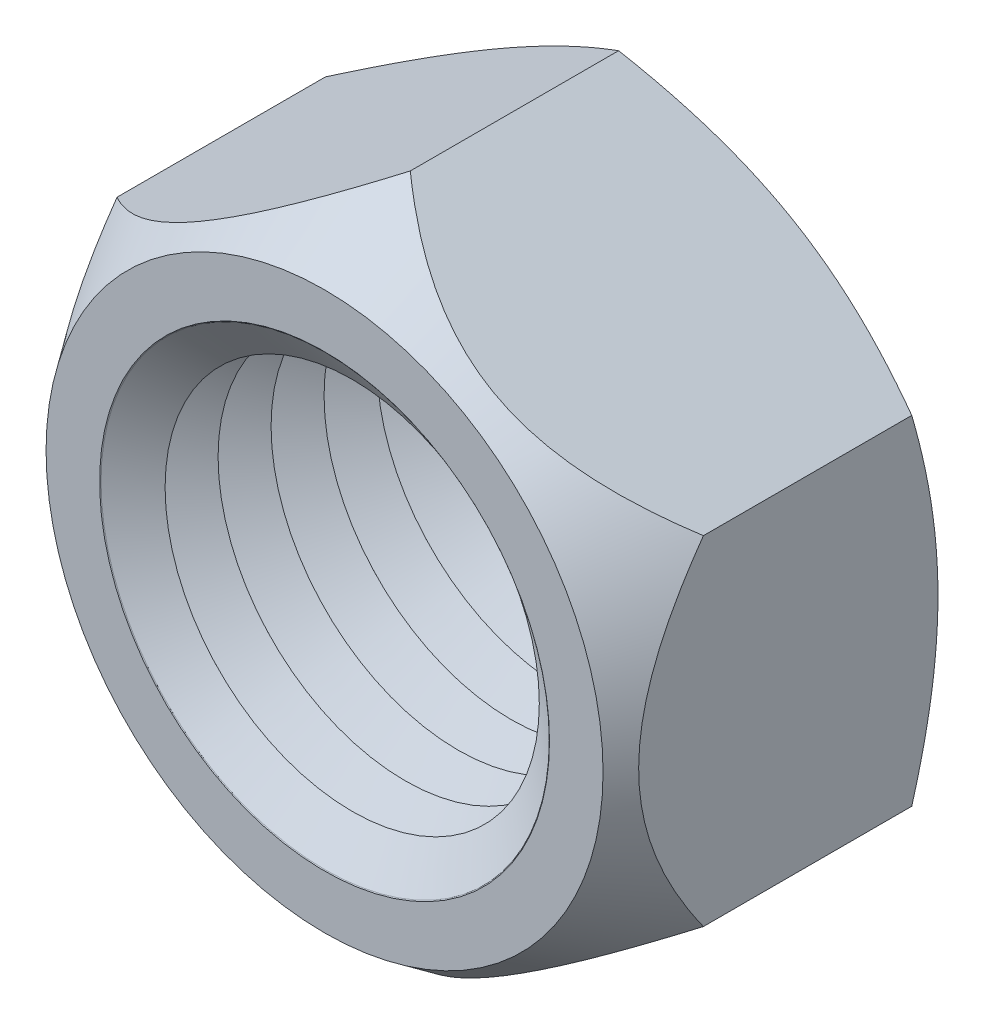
ISO-10303-21;
HEADER;
FILE_DESCRIPTION(('STEP AP214'),'2;1');
FILE_NAME('part.step','',(''),(''),'','','');
FILE_SCHEMA(('AUTOMOTIVE_DESIGN { 1 0 10303 214 1 1 1 1 }'));
ENDSEC;
DATA;
#1=APPLICATION_CONTEXT('core data for automotive mechanical design processes');
#2=APPLICATION_PROTOCOL_DEFINITION('international standard','automotive_design',2000,#1);
#3=PRODUCT_CONTEXT('',#1,'mechanical');
#4=PRODUCT('Part','Part','',(#3));
#5=PRODUCT_RELATED_PRODUCT_CATEGORY('part','',(#4));
#6=PRODUCT_DEFINITION_FORMATION('','',#4);
#7=PRODUCT_DEFINITION_CONTEXT('part definition',#1,'design');
#8=PRODUCT_DEFINITION('design','',#6,#7);
#9=PRODUCT_DEFINITION_SHAPE('','',#8);
#10=(LENGTH_UNIT() NAMED_UNIT(*) SI_UNIT(.MILLI.,.METRE.));
#11=(NAMED_UNIT(*) PLANE_ANGLE_UNIT() SI_UNIT($,.RADIAN.));
#12=(NAMED_UNIT(*) SI_UNIT($,.STERADIAN.) SOLID_ANGLE_UNIT());
#13=UNCERTAINTY_MEASURE_WITH_UNIT(LENGTH_MEASURE(1.E-05),#10,'distance_accuracy_value','');
#14=(GEOMETRIC_REPRESENTATION_CONTEXT(3) GLOBAL_UNCERTAINTY_ASSIGNED_CONTEXT((#13)) GLOBAL_UNIT_ASSIGNED_CONTEXT((#10,
#11,#12)) REPRESENTATION_CONTEXT('',''));
#15=CARTESIAN_POINT('',(0.,0.,0.));
#16=DIRECTION('',(0.,0.,1.));
#17=DIRECTION('',(1.,0.,0.));
#18=AXIS2_PLACEMENT_3D('',#15,#16,#17);
#19=CARTESIAN_POINT('',(0.,7.50555349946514,-7.1));
#20=DIRECTION('',(-0.500000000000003,0.866025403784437,0.));
#21=DIRECTION('',(-0.866025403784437,-0.500000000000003,0.));
#22=AXIS2_PLACEMENT_3D('',#19,#20,#21);
#23=PLANE('',#22);
#24=DIRECTION('',(0.,0.,1.));
#25=VECTOR('',#24,1.);
#26=CARTESIAN_POINT('',(-6.5,3.75277674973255,-7.1));
#27=LINE('',#26,#25);
#28=CARTESIAN_POINT('',(-6.5,3.75277674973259,-6.51944341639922));
#29=VERTEX_POINT('',#28);
#30=CARTESIAN_POINT('',(-6.5,3.75277674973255,-1.90022732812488));
#31=VERTEX_POINT('',#30);
#32=EDGE_CURVE('E146',#29,#31,#27,.T.);
#33=ORIENTED_EDGE('',*,*,#32,.T.);
#34=CARTESIAN_POINT('',(-6.5002,3.75266127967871,-1.90039224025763));
#35=CARTESIAN_POINT('',(-6.43030638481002,3.79301437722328,-1.84276391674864));
#36=CARTESIAN_POINT('',(-6.35984649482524,3.83369441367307,-1.78605340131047));
#37=CARTESIAN_POINT('',(-6.21769338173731,3.91576655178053,-1.67469364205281));
#38=CARTESIAN_POINT('',(-6.14599988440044,3.95715881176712,-1.62004486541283));
#39=CARTESIAN_POINT('',(-5.92849119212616,4.08273751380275,-1.45921760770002));
#40=CARTESIAN_POINT('',(-5.78070483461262,4.16806200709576,-1.35653915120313));
#41=CARTESIAN_POINT('',(-5.47618935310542,4.34387410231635,-1.16097929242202));
#42=CARTESIAN_POINT('',(-5.31933714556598,4.43443276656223,-1.06835130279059));
#43=CARTESIAN_POINT('',(-4.99947791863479,4.61910357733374,-0.898933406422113));
#44=CARTESIAN_POINT('',(-4.83647955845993,4.71321072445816,-0.822122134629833));
#45=CARTESIAN_POINT('',(-4.55723148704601,4.87443467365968,-0.709447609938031));
#46=CARTESIAN_POINT('',(-4.44257193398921,4.94063339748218,-0.66832663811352));
#47=CARTESIAN_POINT('',(-4.21079269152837,5.07445120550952,-0.596523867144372));
#48=CARTESIAN_POINT('',(-4.09367294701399,5.14207032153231,-0.565842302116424));
#49=CARTESIAN_POINT('',(-3.8587182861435,5.27772145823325,-0.516308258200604));
#50=CARTESIAN_POINT('',(-3.74090108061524,5.34574325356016,-0.497344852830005));
#51=CARTESIAN_POINT('',(-3.50426924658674,5.48236270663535,-0.471574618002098));
#52=CARTESIAN_POINT('',(-3.38545468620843,5.55096032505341,-0.464766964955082));
#53=CARTESIAN_POINT('',(-3.14745443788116,5.68836983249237,-0.463608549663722));
#54=CARTESIAN_POINT('',(-3.02826862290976,5.75718179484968,-0.469291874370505));
#55=CARTESIAN_POINT('',(-2.79081684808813,5.89427464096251,-0.492929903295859));
#56=CARTESIAN_POINT('',(-2.67255095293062,5.96255548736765,-0.510885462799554));
#57=CARTESIAN_POINT('',(-2.43663452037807,6.09876190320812,-0.558543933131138));
#58=CARTESIAN_POINT('',(-2.31900127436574,6.16667748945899,-0.588359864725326));
#59=CARTESIAN_POINT('',(-2.08616917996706,6.30110316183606,-0.658594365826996));
#60=CARTESIAN_POINT('',(-1.9709702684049,6.36761328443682,-0.699012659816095));
#61=CARTESIAN_POINT('',(-1.68852237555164,6.53068465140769,-0.810888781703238));
#62=CARTESIAN_POINT('',(-1.52292759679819,6.62629084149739,-0.887920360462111));
#63=CARTESIAN_POINT('',(-1.19804471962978,6.81386205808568,-1.05838662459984));
#64=CARTESIAN_POINT('',(-1.03876610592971,6.90582160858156,-1.1518449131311));
#65=CARTESIAN_POINT('',(-0.7296323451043,7.08430006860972,-1.34947648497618));
#66=CARTESIAN_POINT('',(-0.579650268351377,7.17089226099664,-1.4533873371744));
#67=CARTESIAN_POINT('',(-0.358984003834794,7.29829398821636,-1.61627110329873));
#68=CARTESIAN_POINT('',(-0.286268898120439,7.34027607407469,-1.67163312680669));
#69=CARTESIAN_POINT('',(-0.142108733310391,7.42350698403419,-1.78448009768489));
#70=CARTESIAN_POINT('',(-0.070663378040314,7.46475597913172,-1.8419645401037));
#71=CARTESIAN_POINT('',(0.000199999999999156,7.50566896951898,-1.90039224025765));
#72=B_SPLINE_CURVE_WITH_KNOTS('',3,(#34,#35,#36,#37,#38,#39,#40,#41,#42,#43,#44,#45,#46,#47,#48,
#49,#50,#51,#52,#53,#54,#55,#56,#57,#58,#59,#60,#61,#62,#63,#64,#65,#66,#67,#68,#69,#70,#71),
.UNSPECIFIED.,.F.,.F.,(4,2,2,2,2,2,2,2,2,2,2,2,2,2,2,2,2,2,4),(0.,0.297495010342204,
0.595057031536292,1.19213126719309,1.80184521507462,2.41073008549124,2.82627683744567,
3.24183290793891,3.6533924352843,4.06492407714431,4.4775801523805,4.89026498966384,
5.30698041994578,5.72368502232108,6.34109186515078,6.95939320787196,7.56487092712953,
7.86656422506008,8.16818620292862),.UNSPECIFIED.);
#73=CARTESIAN_POINT('',(0.,7.50555349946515,-1.90022732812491));
#74=VERTEX_POINT('',#73);
#75=EDGE_CURVE('E60',#31,#74,#72,.T.);
#76=ORIENTED_EDGE('',*,*,#75,.T.);
#77=DIRECTION('',(0.,0.,1.));
#78=VECTOR('',#77,1.);
#79=CARTESIAN_POINT('',(0.,7.50555349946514,-7.1));
#80=LINE('',#79,#78);
#81=CARTESIAN_POINT('',(0.,7.50555349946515,-6.51944341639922));
#82=VERTEX_POINT('',#81);
#83=EDGE_CURVE('E129',#82,#74,#80,.T.);
#84=ORIENTED_EDGE('',*,*,#83,.F.);
#85=CARTESIAN_POINT('',(-6.5002,3.75266127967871,-6.51937674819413));
#86=CARTESIAN_POINT('',(-6.35732254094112,3.83515161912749,-6.56699557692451));
#87=CARTESIAN_POINT('',(-6.21391236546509,3.91794952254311,-6.61245329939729));
#88=CARTESIAN_POINT('',(-5.92592736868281,4.08421773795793,-6.69845131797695));
#89=CARTESIAN_POINT('',(-5.78135207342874,4.16768832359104,-6.73898949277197));
#90=CARTESIAN_POINT('',(-5.34531134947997,4.4194365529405,-6.85242899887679));
#91=CARTESIAN_POINT('',(-5.05212471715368,4.58870793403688,-6.91695219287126));
#92=CARTESIAN_POINT('',(-4.61337625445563,4.84201947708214,-6.99261341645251));
#93=CARTESIAN_POINT('',(-4.46912536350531,4.92530276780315,-7.01416714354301));
#94=CARTESIAN_POINT('',(-4.17997178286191,5.09224566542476,-7.05030968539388));
#95=CARTESIAN_POINT('',(-4.03506915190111,5.17590523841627,-7.06489911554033));
#96=CARTESIAN_POINT('',(-3.74501222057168,5.34336968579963,-7.08674124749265));
#97=CARTESIAN_POINT('',(-3.59985839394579,5.42717428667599,-7.09400227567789));
#98=CARTESIAN_POINT('',(-3.30942466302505,5.59485627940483,-7.10103969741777));
#99=CARTESIAN_POINT('',(-3.16414476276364,5.6787336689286,-7.10081632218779));
#100=CARTESIAN_POINT('',(-2.76612405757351,5.90853103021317,-7.08991654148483));
#101=CARTESIAN_POINT('',(-2.51351353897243,6.05437578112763,-7.07161818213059));
#102=CARTESIAN_POINT('',(-2.00997032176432,6.34509659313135,-7.01359365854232));
#103=CARTESIAN_POINT('',(-1.75903939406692,6.48997163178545,-6.97384766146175));
#104=CARTESIAN_POINT('',(-1.25448277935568,6.78127752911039,-6.87449409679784));
#105=CARTESIAN_POINT('',(-1.00092075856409,6.92767163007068,-6.81446557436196));
#106=CARTESIAN_POINT('',(-0.497578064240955,7.21827667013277,-6.67822500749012));
#107=CARTESIAN_POINT('',(-0.247790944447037,7.3624913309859,-6.60204496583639));
#108=CARTESIAN_POINT('',(0.000199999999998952,7.50566896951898,-6.51937674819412));
#109=B_SPLINE_CURVE_WITH_KNOTS('',3,(#85,#86,#87,#88,#89,#90,#91,#92,#93,#94,#95,#96,#97,#98,
#99,#100,#101,#102,#103,#104,#105,#106,#107,#108),.UNSPECIFIED.,.F.,.F.,(4,2,2,2,2,2,2,2,2,2,2,
4),(0.,0.515105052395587,1.03043143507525,2.06322554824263,2.56697389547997,3.07067772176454,
3.57380860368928,4.0769239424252,4.95279354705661,5.82947446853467,6.72559912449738,
7.61996451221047),.UNSPECIFIED.);
#110=CARTESIAN_POINT('',(-3.25000000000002,5.62916512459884,-7.1));
#111=VERTEX_POINT('',#110);
#112=EDGE_CURVE('E149',#111,#82,#109,.T.);
#113=ORIENTED_EDGE('',*,*,#112,.F.);
#114=EDGE_CURVE('E272',#29,#111,#109,.T.);
#115=ORIENTED_EDGE('',*,*,#114,.F.);
#116=EDGE_LOOP('',(#33,#76,#84,#113,#115));
#117=FACE_BOUND('',#116,.T.);
#118=ADVANCED_FACE('F39',(#117),#23,.T.);
#119=CARTESIAN_POINT('',(6.5,3.75277674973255,-7.1));
#120=DIRECTION('',(0.500000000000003,0.866025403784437,0.));
#121=DIRECTION('',(-0.866025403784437,0.500000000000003,0.));
#122=AXIS2_PLACEMENT_3D('',#119,#120,#121);
#123=PLANE('',#122);
#124=ORIENTED_EDGE('',*,*,#83,.T.);
#125=CARTESIAN_POINT('',(-0.000200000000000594,7.50566896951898,-1.90039224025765));
#126=CARTESIAN_POINT('',(0.0696936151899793,7.46531587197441,-1.84276391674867));
#127=CARTESIAN_POINT('',(0.14015350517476,7.42463583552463,-1.78605340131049));
#128=CARTESIAN_POINT('',(0.282306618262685,7.34256369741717,-1.67469364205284));
#129=CARTESIAN_POINT('',(0.354000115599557,7.30117143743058,-1.62004486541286));
#130=CARTESIAN_POINT('',(0.571508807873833,7.17559273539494,-1.45921760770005));
#131=CARTESIAN_POINT('',(0.719295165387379,7.09026824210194,-1.35653915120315));
#132=CARTESIAN_POINT('',(1.02381064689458,6.91445614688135,-1.16097929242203));
#133=CARTESIAN_POINT('',(1.18066285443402,6.82389748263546,-1.06835130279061));
#134=CARTESIAN_POINT('',(1.50052208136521,6.63922667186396,-0.898933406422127));
#135=CARTESIAN_POINT('',(1.66352044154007,6.54511952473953,-0.822122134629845));
#136=CARTESIAN_POINT('',(1.94276851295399,6.38389557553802,-0.70944760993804));
#137=CARTESIAN_POINT('',(2.05742806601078,6.31769685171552,-0.668326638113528));
#138=CARTESIAN_POINT('',(2.28920730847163,6.18387904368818,-0.596523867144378));
#139=CARTESIAN_POINT('',(2.406327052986,6.11625992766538,-0.565842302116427));
#140=CARTESIAN_POINT('',(2.64128171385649,5.98060879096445,-0.516308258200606));
#141=CARTESIAN_POINT('',(2.75909891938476,5.91258699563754,-0.497344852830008));
#142=CARTESIAN_POINT('',(2.99573075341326,5.77596754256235,-0.471574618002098));
#143=CARTESIAN_POINT('',(3.11454531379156,5.70736992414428,-0.46476696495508));
#144=CARTESIAN_POINT('',(3.35254556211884,5.56996041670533,-0.463608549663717));
#145=CARTESIAN_POINT('',(3.47173137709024,5.50114845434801,-0.4692918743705));
#146=CARTESIAN_POINT('',(3.70918315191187,5.36405560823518,-0.492929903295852));
#147=CARTESIAN_POINT('',(3.82744904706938,5.29577476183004,-0.510885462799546));
#148=CARTESIAN_POINT('',(4.06336547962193,5.15956834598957,-0.558543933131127));
#149=CARTESIAN_POINT('',(4.18099872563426,5.0916527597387,-0.588359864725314));
#150=CARTESIAN_POINT('',(4.41383082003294,4.95722708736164,-0.658594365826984));
#151=CARTESIAN_POINT('',(4.5290297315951,4.89071696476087,-0.699012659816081));
#152=CARTESIAN_POINT('',(4.81147762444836,4.72764559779,-0.810888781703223));
#153=CARTESIAN_POINT('',(4.97707240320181,4.6320394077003,-0.887920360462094));
#154=CARTESIAN_POINT('',(5.30195528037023,4.44446819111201,-1.05838662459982));
#155=CARTESIAN_POINT('',(5.46123389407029,4.35250864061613,-1.15184491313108));
#156=CARTESIAN_POINT('',(5.7703676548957,4.17403018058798,-1.34947648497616));
#157=CARTESIAN_POINT('',(5.92034973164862,4.08743798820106,-1.45338733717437));
#158=CARTESIAN_POINT('',(6.14101599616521,3.96003626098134,-1.6162711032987));
#159=CARTESIAN_POINT('',(6.21373110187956,3.918054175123,-1.67163312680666));
#160=CARTESIAN_POINT('',(6.35789126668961,3.8348232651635,-1.78448009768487));
#161=CARTESIAN_POINT('',(6.42933662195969,3.79357427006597,-1.84196454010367));
#162=CARTESIAN_POINT('',(6.5002,3.75266127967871,-1.90039224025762));
#163=B_SPLINE_CURVE_WITH_KNOTS('',3,(#125,#126,#127,#128,#129,#130,#131,#132,#133,#134,#135,
#136,#137,#138,#139,#140,#141,#142,#143,#144,#145,#146,#147,#148,#149,#150,#151,#152,#153,#154,
#155,#156,#157,#158,#159,#160,#161,#162),.UNSPECIFIED.,.F.,.F.,(4,2,2,2,2,2,2,2,2,2,2,2,2,2,2,2,
2,2,4),(0.,0.297495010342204,0.595057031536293,1.19213126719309,1.80184521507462,
2.41073008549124,2.82627683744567,3.24183290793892,3.6533924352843,4.06492407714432,
4.47758015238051,4.89026498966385,5.30698041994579,5.72368502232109,6.34109186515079,
6.95939320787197,7.56487092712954,7.86656422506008,8.16818620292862),.UNSPECIFIED.);
#164=CARTESIAN_POINT('',(6.5,3.75277674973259,-1.90022732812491));
#165=VERTEX_POINT('',#164);
#166=EDGE_CURVE('E112',#74,#165,#163,.T.);
#167=ORIENTED_EDGE('',*,*,#166,.T.);
#168=DIRECTION('',(0.,0.,1.));
#169=VECTOR('',#168,1.);
#170=CARTESIAN_POINT('',(6.5,3.75277674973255,-7.1));
#171=LINE('',#170,#169);
#172=CARTESIAN_POINT('',(6.5,3.75277674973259,-6.51944341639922));
#173=VERTEX_POINT('',#172);
#174=EDGE_CURVE('E130',#173,#165,#171,.T.);
#175=ORIENTED_EDGE('',*,*,#174,.F.);
#176=CARTESIAN_POINT('',(-0.000200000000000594,7.50566896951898,-6.51937674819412));
#177=CARTESIAN_POINT('',(0.142677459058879,7.42317863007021,-6.5669955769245));
#178=CARTESIAN_POINT('',(0.286087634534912,7.34038072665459,-6.61245329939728));
#179=CARTESIAN_POINT('',(0.574072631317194,7.17411251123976,-6.69845131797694));
#180=CARTESIAN_POINT('',(0.718647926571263,7.09064192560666,-6.73898949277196));
#181=CARTESIAN_POINT('',(1.15468865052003,6.83889369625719,-6.85242899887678));
#182=CARTESIAN_POINT('',(1.44787528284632,6.66962231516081,-6.91695219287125));
#183=CARTESIAN_POINT('',(1.88662374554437,6.41631077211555,-6.9926134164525));
#184=CARTESIAN_POINT('',(2.03087463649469,6.33302748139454,-7.01416714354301));
#185=CARTESIAN_POINT('',(2.32002821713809,6.16608458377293,-7.05030968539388));
#186=CARTESIAN_POINT('',(2.46493084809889,6.08242501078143,-7.06489911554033));
#187=CARTESIAN_POINT('',(2.75498777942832,5.91496056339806,-7.08674124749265));
#188=CARTESIAN_POINT('',(2.90014160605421,5.8311559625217,-7.09400227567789));
#189=CARTESIAN_POINT('',(3.19057533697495,5.66347396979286,-7.10103969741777));
#190=CARTESIAN_POINT('',(3.33585523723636,5.57959658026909,-7.1008163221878));
#191=CARTESIAN_POINT('',(3.73387594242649,5.34979921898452,-7.08991654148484));
#192=CARTESIAN_POINT('',(3.98648646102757,5.20395446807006,-7.07161818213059));
#193=CARTESIAN_POINT('',(4.49002967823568,4.91323365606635,-7.01359365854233));
#194=CARTESIAN_POINT('',(4.74096060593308,4.76835861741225,-6.97384766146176));
#195=CARTESIAN_POINT('',(5.24551722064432,4.4770527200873,-6.87449409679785));
#196=CARTESIAN_POINT('',(5.49907924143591,4.33065861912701,-6.81446557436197));
#197=CARTESIAN_POINT('',(6.00242193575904,4.04005357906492,-6.67822500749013));
#198=CARTESIAN_POINT('',(6.25220905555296,3.8958389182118,-6.6020449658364));
#199=CARTESIAN_POINT('',(6.5002,3.75266127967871,-6.51937674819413));
#200=B_SPLINE_CURVE_WITH_KNOTS('',3,(#176,#177,#178,#179,#180,#181,#182,#183,#184,#185,#186,
#187,#188,#189,#190,#191,#192,#193,#194,#195,#196,#197,#198,#199),.UNSPECIFIED.,.F.,.F.,(4,2,2,
2,2,2,2,2,2,2,2,4),(0.,0.515105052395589,1.03043143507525,2.06322554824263,2.56697389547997,
3.07067772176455,3.57380860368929,4.07692394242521,4.95279354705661,5.82947446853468,
6.72559912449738,7.61996451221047),.UNSPECIFIED.);
#201=CARTESIAN_POINT('',(3.25000000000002,5.62916512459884,-7.1));
#202=VERTEX_POINT('',#201);
#203=EDGE_CURVE('E264',#202,#173,#200,.T.);
#204=ORIENTED_EDGE('',*,*,#203,.F.);
#205=EDGE_CURVE('E269',#82,#202,#200,.T.);
#206=ORIENTED_EDGE('',*,*,#205,.F.);
#207=EDGE_LOOP('',(#124,#167,#175,#204,#206));
#208=FACE_BOUND('',#207,.T.);
#209=ADVANCED_FACE('F123',(#208),#123,.T.);
#210=CARTESIAN_POINT('',(6.5,3.75277674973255,-7.1));
#211=DIRECTION('',(-1.,0.,0.));
#212=DIRECTION('',(0.,0.,1.));
#213=AXIS2_PLACEMENT_3D('',#210,#211,#212);
#214=PLANE('',#213);
#215=CARTESIAN_POINT('',(6.5,-6.61065706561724,-4.42149584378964));
#216=CARTESIAN_POINT('',(6.5,-6.46781644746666,-4.27606574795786));
#217=CARTESIAN_POINT('',(6.5,-6.32383830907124,-4.13173612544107));
#218=CARTESIAN_POINT('',(6.5,-6.03318944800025,-3.84574093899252));
#219=CARTESIAN_POINT('',(6.5,-5.88651803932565,-3.70407607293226));
#220=CARTESIAN_POINT('',(6.5,-5.58888533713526,-3.42276472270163));
#221=CARTESIAN_POINT('',(6.5,-5.43789825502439,-3.28314543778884));
#222=CARTESIAN_POINT('',(6.5,-5.13236776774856,-3.0078677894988));
#223=CARTESIAN_POINT('',(6.5,-4.97782463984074,-2.87220911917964));
#224=CARTESIAN_POINT('',(6.5,-4.6530166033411,-2.59585947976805));
#225=CARTESIAN_POINT('',(6.5,-4.48243471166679,-2.45553930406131));
#226=CARTESIAN_POINT('',(6.5,-4.1356622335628,-2.18189469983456));
#227=CARTESIAN_POINT('',(6.5,-3.959470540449,-2.04857166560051));
#228=CARTESIAN_POINT('',(6.5,-3.60119623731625,-1.79134610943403));
#229=CARTESIAN_POINT('',(6.5,-3.41913552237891,-1.66741330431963));
#230=CARTESIAN_POINT('',(6.5,-3.0476902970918,-1.43114834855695));
#231=CARTESIAN_POINT('',(6.5,-2.85830983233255,-1.31880991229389));
#232=CARTESIAN_POINT('',(6.5,-2.4963724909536,-1.12273808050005));
#233=CARTESIAN_POINT('',(6.5,-2.32481002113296,-1.03718423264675));
#234=CARTESIAN_POINT('',(6.5,-1.97513806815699,-0.880365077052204));
#235=CARTESIAN_POINT('',(6.5,-1.79702718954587,-0.809102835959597));
#236=CARTESIAN_POINT('',(6.5,-1.43766441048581,-0.685294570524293));
#237=CARTESIAN_POINT('',(6.5,-1.25651512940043,-0.63245497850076));
#238=CARTESIAN_POINT('',(6.5,-0.889489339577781,-0.547106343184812));
#239=CARTESIAN_POINT('',(6.5,-0.703616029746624,-0.514583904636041));
#240=CARTESIAN_POINT('',(6.5,-0.381844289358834,-0.478170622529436));
#241=CARTESIAN_POINT('',(6.5,-0.246550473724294,-0.46880787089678));
#242=CARTESIAN_POINT('',(6.5,0.0243231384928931,-0.462200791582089));
#243=CARTESIAN_POINT('',(6.5,0.159902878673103,-0.464954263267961));
#244=CARTESIAN_POINT('',(6.5,0.430547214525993,-0.482481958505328));
#245=CARTESIAN_POINT('',(6.5,0.56561022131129,-0.49728039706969));
#246=CARTESIAN_POINT('',(6.5,0.833988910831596,-0.538304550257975));
#247=CARTESIAN_POINT('',(6.5,0.967304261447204,-0.564532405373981));
#248=CARTESIAN_POINT('',(6.5,1.27210105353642,-0.637127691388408));
#249=CARTESIAN_POINT('',(6.5,1.44269865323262,-0.687209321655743));
#250=CARTESIAN_POINT('',(6.5,1.77864942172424,-0.802596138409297));
#251=CARTESIAN_POINT('',(6.5,1.94400023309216,-0.867908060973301));
#252=CARTESIAN_POINT('',(6.5,2.27086582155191,-1.01182402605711));
#253=CARTESIAN_POINT('',(6.5,2.43232074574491,-1.09056261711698));
#254=CARTESIAN_POINT('',(6.5,2.74964562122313,-1.25837095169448));
#255=CARTESIAN_POINT('',(6.5,2.90551724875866,-1.3474375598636));
#256=CARTESIAN_POINT('',(6.5,3.28905559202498,-1.58065432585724));
#257=CARTESIAN_POINT('',(6.5,3.51353366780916,-1.73003174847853));
#258=CARTESIAN_POINT('',(6.5,3.95281813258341,-2.0424848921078));
#259=CARTESIAN_POINT('',(6.5,4.16761774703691,-2.20556998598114));
#260=CARTESIAN_POINT('',(6.5,4.58990029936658,-2.54249811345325));
#261=CARTESIAN_POINT('',(6.5,4.79735207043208,-2.71637995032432));
#262=CARTESIAN_POINT('',(6.5,5.20545032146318,-3.07180147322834));
#263=CARTESIAN_POINT('',(6.5,5.40609854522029,-3.25333916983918));
#264=CARTESIAN_POINT('',(6.5,5.78875758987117,-3.61018893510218));
#265=CARTESIAN_POINT('',(6.5,5.97112440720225,-3.78512100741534));
#266=CARTESIAN_POINT('',(6.5,6.33177860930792,-4.13916248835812));
#267=CARTESIAN_POINT('',(6.5,6.51006562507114,-4.31827227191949));
#268=CARTESIAN_POINT('',(6.5,6.86157883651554,-4.67823217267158));
#269=CARTESIAN_POINT('',(6.5,7.03483620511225,-4.85905193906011));
#270=CARTESIAN_POINT('',(6.5,7.37838312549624,-5.22340778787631));
#271=CARTESIAN_POINT('',(6.5,7.5486733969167,-5.40694319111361));
#272=CARTESIAN_POINT('',(6.5,7.71774020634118,-5.5915825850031));
#273=B_SPLINE_CURVE_WITH_KNOTS('',3,(#215,#216,#217,#218,#219,#220,#221,#222,#223,#224,#225,
#226,#227,#228,#229,#230,#231,#232,#233,#234,#235,#236,#237,#238,#239,#240,#241,#242,#243,#244,
#245,#246,#247,#248,#249,#250,#251,#252,#253,#254,#255,#256,#257,#258,#259,#260,#261,#262,#263,
#264,#265,#266,#267,#268,#269,#270,#271,#272),.UNSPECIFIED.,.F.,.F.,(4,2,2,2,2,2,2,2,2,2,2,2,2,
2,2,2,2,2,2,2,2,2,2,2,2,2,2,2,4),(0.,0.611550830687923,1.22325965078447,1.84014138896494,
2.45697519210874,3.11946767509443,3.78209167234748,4.44247872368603,5.10250586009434,
5.67711883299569,6.25185497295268,6.81696201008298,7.38169607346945,7.78804293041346,
8.19431598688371,8.6014078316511,9.00857594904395,9.54107928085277,10.0738185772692,
10.6122492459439,11.1505168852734,11.9586736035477,12.7673874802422,13.5791981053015,
14.3907990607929,15.148829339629,15.9069279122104,16.6581761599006,17.4092395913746),.UNSPECIFIED.);
#274=CARTESIAN_POINT('',(6.49999999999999,-3.75277674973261,-1.90022732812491));
#275=VERTEX_POINT('',#274);
#276=EDGE_CURVE('E111',#275,#165,#273,.T.);
#277=ORIENTED_EDGE('',*,*,#276,.F.);
#278=DIRECTION('',(0.,0.,1.));
#279=VECTOR('',#278,1.);
#280=CARTESIAN_POINT('',(6.5,-3.7527767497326,-7.1));
#281=LINE('',#280,#279);
#282=CARTESIAN_POINT('',(6.49999999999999,-3.75277674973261,-6.51944341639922));
#283=VERTEX_POINT('',#282);
#284=EDGE_CURVE('E138',#283,#275,#281,.T.);
#285=ORIENTED_EDGE('',*,*,#284,.F.);
#286=CARTESIAN_POINT('',(6.5,-9.95291698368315,-3.98957641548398));
#287=CARTESIAN_POINT('',(6.5,-9.66753022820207,-4.12749106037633));
#288=CARTESIAN_POINT('',(6.5,-9.3814687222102,-4.26403471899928));
#289=CARTESIAN_POINT('',(6.5,-8.80763137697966,-4.53359663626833));
#290=CARTESIAN_POINT('',(6.5,-8.51985525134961,-4.66661428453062));
#291=CARTESIAN_POINT('',(6.5,-7.94066929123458,-4.92904149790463));
#292=CARTESIAN_POINT('',(6.5,-7.64924808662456,-5.05842605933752));
#293=CARTESIAN_POINT('',(6.5,-7.06401043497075,-5.31163779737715));
#294=CARTESIAN_POINT('',(6.5,-6.77019411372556,-5.43546526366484));
#295=CARTESIAN_POINT('',(6.5,-6.17605150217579,-5.67755519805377));
#296=CARTESIAN_POINT('',(6.5,-5.87568957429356,-5.79573068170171));
#297=CARTESIAN_POINT('',(6.5,-5.27142269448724,-6.02282610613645));
#298=CARTESIAN_POINT('',(6.5,-4.96751735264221,-6.131745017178));
#299=CARTESIAN_POINT('',(6.5,-4.35630541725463,-6.33740097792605));
#300=CARTESIAN_POINT('',(6.5,-4.04900762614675,-6.43416392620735));
#301=CARTESIAN_POINT('',(6.5,-3.43004022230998,-6.6123642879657));
#302=CARTESIAN_POINT('',(6.5,-3.11837202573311,-6.69380654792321));
#303=CARTESIAN_POINT('',(6.5,-2.49046594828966,-6.83741591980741));
#304=CARTESIAN_POINT('',(6.5,-2.17422687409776,-6.89957789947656));
#305=CARTESIAN_POINT('',(6.5,-1.53789167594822,-7.00042577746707));
#306=CARTESIAN_POINT('',(6.5,-1.21779554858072,-7.03911165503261));
#307=CARTESIAN_POINT('',(6.5,-0.737141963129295,-7.077053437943));
#308=CARTESIAN_POINT('',(6.5,-0.577336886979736,-7.08635478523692));
#309=CARTESIAN_POINT('',(6.5,-0.257468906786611,-7.09818591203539));
#310=CARTESIAN_POINT('',(6.5,-0.0974060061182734,-7.10071577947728));
#311=CARTESIAN_POINT('',(6.5,0.22263544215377,-7.09893598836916));
#312=CARTESIAN_POINT('',(6.5,0.382614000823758,-7.09462824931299));
#313=CARTESIAN_POINT('',(6.5,0.70225063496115,-7.07928241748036));
#314=CARTESIAN_POINT('',(6.5,0.861908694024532,-7.06824398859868));
#315=CARTESIAN_POINT('',(6.5,1.24887053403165,-7.03356313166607));
#316=CARTESIAN_POINT('',(6.5,1.47587694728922,-7.00654812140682));
#317=CARTESIAN_POINT('',(6.5,1.92815030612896,-6.94041011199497));
#318=CARTESIAN_POINT('',(6.5,2.15341675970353,-6.9012838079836));
#319=CARTESIAN_POINT('',(6.5,2.60202427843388,-6.8123108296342));
#320=CARTESIAN_POINT('',(6.5,2.82536331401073,-6.76245401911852));
#321=CARTESIAN_POINT('',(6.5,3.26974354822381,-6.65354123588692));
#322=CARTESIAN_POINT('',(6.5,3.49078496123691,-6.59448612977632));
#323=CARTESIAN_POINT('',(6.5,3.93601414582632,-6.46704588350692));
#324=CARTESIAN_POINT('',(6.5,4.16014622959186,-6.39846752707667));
#325=CARTESIAN_POINT('',(6.5,4.60604131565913,-6.25453487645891));
#326=CARTESIAN_POINT('',(6.5,4.82780583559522,-6.17918525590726));
#327=CARTESIAN_POINT('',(6.5,5.2680759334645,-6.02326649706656));
#328=CARTESIAN_POINT('',(6.5,5.48659282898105,-5.94272912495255));
#329=CARTESIAN_POINT('',(6.5,5.92193123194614,-5.77692729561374));
#330=CARTESIAN_POINT('',(6.5,6.1387520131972,-5.69166092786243));
#331=CARTESIAN_POINT('',(6.5,6.35478510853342,-5.60449786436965));
#332=B_SPLINE_CURVE_WITH_KNOTS('',3,(#286,#287,#288,#289,#290,#291,#292,#293,#294,#295,#296,
#297,#298,#299,#300,#301,#302,#303,#304,#305,#306,#307,#308,#309,#310,#311,#312,#313,#314,#315,
#316,#317,#318,#319,#320,#321,#322,#323,#324,#325,#326,#327,#328,#329,#330,#331),.UNSPECIFIED.,
.F.,.F.,(4,2,2,2,2,2,2,2,2,2,2,2,2,2,2,2,2,2,2,2,2,2,4),(0.,0.950904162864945,1.90197187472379,
2.85848216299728,3.81494253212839,4.78314526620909,5.75145556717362,6.71766655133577,
7.6835713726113,8.64973308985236,9.61589566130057,10.0960003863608,10.5760988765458,
11.0560626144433,11.5360503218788,12.2214931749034,12.9071232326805,13.5934038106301,
14.2796197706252,14.9826563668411,15.6852113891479,16.3838119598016,17.082696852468),.UNSPECIFIED.);
#333=CARTESIAN_POINT('',(6.5,0.,-7.1));
#334=VERTEX_POINT('',#333);
#335=EDGE_CURVE('E276',#283,#334,#332,.T.);
#336=ORIENTED_EDGE('',*,*,#335,.T.);
#337=EDGE_CURVE('E132',#334,#173,#332,.T.);
#338=ORIENTED_EDGE('',*,*,#337,.T.);
#339=ORIENTED_EDGE('',*,*,#174,.T.);
#340=EDGE_LOOP('',(#277,#285,#336,#338,#339));
#341=FACE_BOUND('',#340,.T.);
#342=ADVANCED_FACE('F131',(#341),#214,.F.);
#343=CARTESIAN_POINT('',(0.,-7.50555349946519,-7.1));
#344=DIRECTION('',(0.500000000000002,-0.866025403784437,0.));
#345=DIRECTION('',(0.866025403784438,0.500000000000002,0.));
#346=AXIS2_PLACEMENT_3D('',#343,#344,#345);
#347=PLANE('',#346);
#348=ORIENTED_EDGE('',*,*,#284,.T.);
#349=CARTESIAN_POINT('',(6.5002,-3.75266127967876,-1.90039224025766));
#350=CARTESIAN_POINT('',(6.43030638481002,-3.79301437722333,-1.84276391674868));
#351=CARTESIAN_POINT('',(6.35984649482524,-3.83369441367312,-1.7860534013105));
#352=CARTESIAN_POINT('',(6.21769338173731,-3.91576655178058,-1.67469364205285));
#353=CARTESIAN_POINT('',(6.14599988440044,-3.95715881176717,-1.62004486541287));
#354=CARTESIAN_POINT('',(5.92849119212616,-4.0827375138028,-1.45921760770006));
#355=CARTESIAN_POINT('',(5.78070483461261,-4.16806200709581,-1.35653915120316));
#356=CARTESIAN_POINT('',(5.47618935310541,-4.3438741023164,-1.16097929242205));
#357=CARTESIAN_POINT('',(5.31933714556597,-4.43443276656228,-1.06835130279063));
#358=CARTESIAN_POINT('',(4.99947791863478,-4.61910357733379,-0.898933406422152));
#359=CARTESIAN_POINT('',(4.83647955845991,-4.71321072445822,-0.822122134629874));
#360=CARTESIAN_POINT('',(4.55723148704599,-4.87443467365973,-0.709447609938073));
#361=CARTESIAN_POINT('',(4.4425719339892,-4.94063339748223,-0.668326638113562));
#362=CARTESIAN_POINT('',(4.21079269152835,-5.07445120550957,-0.596523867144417));
#363=CARTESIAN_POINT('',(4.09367294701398,-5.14207032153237,-0.565842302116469));
#364=CARTESIAN_POINT('',(3.85871828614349,-5.2777214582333,-0.516308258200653));
#365=CARTESIAN_POINT('',(3.74090108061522,-5.34574325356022,-0.497344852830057));
#366=CARTESIAN_POINT('',(3.50426924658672,-5.48236270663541,-0.471574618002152));
#367=CARTESIAN_POINT('',(3.38545468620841,-5.55096032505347,-0.464766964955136));
#368=CARTESIAN_POINT('',(3.14745443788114,-5.68836983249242,-0.463608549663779));
#369=CARTESIAN_POINT('',(3.02826862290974,-5.75718179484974,-0.469291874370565));
#370=CARTESIAN_POINT('',(2.79081684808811,-5.89427464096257,-0.492929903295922));
#371=CARTESIAN_POINT('',(2.6725509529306,-5.96255548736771,-0.510885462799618));
#372=CARTESIAN_POINT('',(2.43663452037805,-6.09876190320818,-0.558543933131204));
#373=CARTESIAN_POINT('',(2.31900127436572,-6.16667748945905,-0.588359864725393));
#374=CARTESIAN_POINT('',(2.08616917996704,-6.30110316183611,-0.658594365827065));
#375=CARTESIAN_POINT('',(1.97097026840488,-6.36761328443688,-0.699012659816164));
#376=CARTESIAN_POINT('',(1.68852237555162,-6.53068465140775,-0.810888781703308));
#377=CARTESIAN_POINT('',(1.52292759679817,-6.62629084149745,-0.887920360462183));
#378=CARTESIAN_POINT('',(1.19804471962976,-6.81386205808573,-1.05838662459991));
#379=CARTESIAN_POINT('',(1.0387661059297,-6.90582160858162,-1.15184491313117));
#380=CARTESIAN_POINT('',(0.72963234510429,-7.08430006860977,-1.34947648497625));
#381=CARTESIAN_POINT('',(0.579650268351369,-7.17089226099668,-1.45338733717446));
#382=CARTESIAN_POINT('',(0.358984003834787,-7.2982939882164,-1.61627110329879));
#383=CARTESIAN_POINT('',(0.286268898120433,-7.34027607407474,-1.67163312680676));
#384=CARTESIAN_POINT('',(0.142108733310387,-7.42350698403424,-1.78448009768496));
#385=CARTESIAN_POINT('',(0.0706633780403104,-7.46475597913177,-1.84196454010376));
#386=CARTESIAN_POINT('',(-0.000200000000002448,-7.50566896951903,-1.90039224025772));
#387=B_SPLINE_CURVE_WITH_KNOTS('',3,(#349,#350,#351,#352,#353,#354,#355,#356,#357,#358,#359,
#360,#361,#362,#363,#364,#365,#366,#367,#368,#369,#370,#371,#372,#373,#374,#375,#376,#377,#378,
#379,#380,#381,#382,#383,#384,#385,#386),.UNSPECIFIED.,.F.,.F.,(4,2,2,2,2,2,2,2,2,2,2,2,2,2,2,2,
2,2,4),(0.,0.297495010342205,0.595057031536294,1.19213126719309,1.80184521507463,
2.41073008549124,2.82627683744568,3.24183290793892,3.65339243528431,4.06492407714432,
4.47758015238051,4.89026498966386,5.3069804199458,5.7236850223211,6.34109186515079,
6.95939320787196,7.56487092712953,7.86656422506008,8.16818620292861),.UNSPECIFIED.);
#388=CARTESIAN_POINT('',(0.,-7.50555349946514,-1.90022732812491));
#389=VERTEX_POINT('',#388);
#390=EDGE_CURVE('E116',#275,#389,#387,.T.);
#391=ORIENTED_EDGE('',*,*,#390,.T.);
#392=DIRECTION('',(0.,0.,1.));
#393=VECTOR('',#392,1.);
#394=CARTESIAN_POINT('',(0.,-7.50555349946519,-7.1));
#395=LINE('',#394,#393);
#396=CARTESIAN_POINT('',(0.,-7.50555349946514,-6.51944341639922));
#397=VERTEX_POINT('',#396);
#398=EDGE_CURVE('E137',#397,#389,#395,.T.);
#399=ORIENTED_EDGE('',*,*,#398,.F.);
#400=CARTESIAN_POINT('',(6.5002,-3.75266127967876,-6.51937674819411));
#401=CARTESIAN_POINT('',(6.35732254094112,-3.83515161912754,-6.5669955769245));
#402=CARTESIAN_POINT('',(6.21391236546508,-3.91794952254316,-6.61245329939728));
#403=CARTESIAN_POINT('',(5.9259273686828,-4.08421773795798,-6.69845131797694));
#404=CARTESIAN_POINT('',(5.78135207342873,-4.16768832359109,-6.73898949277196));
#405=CARTESIAN_POINT('',(5.34531134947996,-4.41943655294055,-6.85242899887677));
#406=CARTESIAN_POINT('',(5.05212471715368,-4.58870793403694,-6.91695219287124));
#407=CARTESIAN_POINT('',(4.61337625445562,-4.84201947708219,-6.99261341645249));
#408=CARTESIAN_POINT('',(4.4691253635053,-4.9253027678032,-7.01416714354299));
#409=CARTESIAN_POINT('',(4.1799717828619,-5.09224566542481,-7.05030968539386));
#410=CARTESIAN_POINT('',(4.0350691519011,-5.17590523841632,-7.06489911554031));
#411=CARTESIAN_POINT('',(3.74501222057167,-5.34336968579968,-7.08674124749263));
#412=CARTESIAN_POINT('',(3.59985839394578,-5.42717428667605,-7.09400227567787));
#413=CARTESIAN_POINT('',(3.30942466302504,-5.59485627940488,-7.10103969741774));
#414=CARTESIAN_POINT('',(3.16414476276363,-5.67873366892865,-7.10081632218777));
#415=CARTESIAN_POINT('',(2.7661240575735,-5.90853103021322,-7.08991654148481));
#416=CARTESIAN_POINT('',(2.51351353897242,-6.05437578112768,-7.07161818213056));
#417=CARTESIAN_POINT('',(2.00997032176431,-6.3450965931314,-7.0135936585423));
#418=CARTESIAN_POINT('',(1.75903939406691,-6.4899716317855,-6.97384766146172));
#419=CARTESIAN_POINT('',(1.25448277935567,-6.78127752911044,-6.87449409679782));
#420=CARTESIAN_POINT('',(1.00092075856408,-6.92767163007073,-6.81446557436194));
#421=CARTESIAN_POINT('',(0.49757806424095,-7.21827667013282,-6.67822500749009));
#422=CARTESIAN_POINT('',(0.247790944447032,-7.36249133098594,-6.60204496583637));
#423=CARTESIAN_POINT('',(-0.000200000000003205,-7.50566896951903,-6.51937674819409));
#424=B_SPLINE_CURVE_WITH_KNOTS('',3,(#400,#401,#402,#403,#404,#405,#406,#407,#408,#409,#410,
#411,#412,#413,#414,#415,#416,#417,#418,#419,#420,#421,#422,#423),.UNSPECIFIED.,.F.,.F.,(4,2,2,
2,2,2,2,2,2,2,2,4),(0.,0.515105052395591,1.03043143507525,2.06322554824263,2.56697389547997,
3.07067772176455,3.57380860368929,4.07692394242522,4.95279354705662,5.82947446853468,
6.72559912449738,7.61996451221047),.UNSPECIFIED.);
#425=CARTESIAN_POINT('',(3.25000000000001,-5.62916512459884,-7.1));
#426=VERTEX_POINT('',#425);
#427=EDGE_CURVE('E282',#426,#397,#424,.T.);
#428=ORIENTED_EDGE('',*,*,#427,.F.);
#429=EDGE_CURVE('E284',#283,#426,#424,.T.);
#430=ORIENTED_EDGE('',*,*,#429,.F.);
#431=EDGE_LOOP('',(#348,#391,#399,#428,#430));
#432=FACE_BOUND('',#431,.T.);
#433=ADVANCED_FACE('F300',(#432),#347,.T.);
#434=CARTESIAN_POINT('',(-6.5,-3.7527767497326,-7.1));
#435=DIRECTION('',(-0.500000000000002,-0.866025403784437,0.));
#436=DIRECTION('',(0.866025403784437,-0.500000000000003,0.));
#437=AXIS2_PLACEMENT_3D('',#434,#435,#436);
#438=PLANE('',#437);
#439=ORIENTED_EDGE('',*,*,#398,.T.);
#440=CARTESIAN_POINT('',(0.000199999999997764,-7.50566896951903,-1.90039224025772));
#441=CARTESIAN_POINT('',(-0.0696936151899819,-7.46531587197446,-1.84276391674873));
#442=CARTESIAN_POINT('',(-0.140153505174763,-7.42463583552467,-1.78605340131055));
#443=CARTESIAN_POINT('',(-0.282306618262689,-7.34256369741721,-1.6746936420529));
#444=CARTESIAN_POINT('',(-0.354000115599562,-7.30117143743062,-1.62004486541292));
#445=CARTESIAN_POINT('',(-0.57150880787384,-7.17559273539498,-1.45921760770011));
#446=CARTESIAN_POINT('',(-0.719295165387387,-7.09026824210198,-1.35653915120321));
#447=CARTESIAN_POINT('',(-1.02381064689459,-6.91445614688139,-1.1609792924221));
#448=CARTESIAN_POINT('',(-1.18066285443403,-6.82389748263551,-1.06835130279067));
#449=CARTESIAN_POINT('',(-1.50052208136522,-6.639226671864,-0.898933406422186));
#450=CARTESIAN_POINT('',(-1.66352044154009,-6.54511952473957,-0.822122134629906));
#451=CARTESIAN_POINT('',(-1.94276851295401,-6.38389557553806,-0.7094476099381));
#452=CARTESIAN_POINT('',(-2.0574280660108,-6.31769685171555,-0.668326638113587));
#453=CARTESIAN_POINT('',(-2.28920730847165,-6.18387904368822,-0.596523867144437));
#454=CARTESIAN_POINT('',(-2.40632705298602,-6.11625992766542,-0.565842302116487));
#455=CARTESIAN_POINT('',(-2.64128171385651,-5.98060879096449,-0.516308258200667));
#456=CARTESIAN_POINT('',(-2.75909891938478,-5.91258699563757,-0.497344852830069));
#457=CARTESIAN_POINT('',(-2.99573075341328,-5.77596754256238,-0.471574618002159));
#458=CARTESIAN_POINT('',(-3.11454531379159,-5.70736992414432,-0.46476696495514));
#459=CARTESIAN_POINT('',(-3.35254556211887,-5.56996041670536,-0.463608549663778));
#460=CARTESIAN_POINT('',(-3.47173137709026,-5.50114845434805,-0.469291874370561));
#461=CARTESIAN_POINT('',(-3.7091831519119,-5.36405560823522,-0.492929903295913));
#462=CARTESIAN_POINT('',(-3.82744904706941,-5.29577476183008,-0.510885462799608));
#463=CARTESIAN_POINT('',(-4.06336547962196,-5.1595683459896,-0.558543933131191));
#464=CARTESIAN_POINT('',(-4.18099872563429,-5.09165275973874,-0.588359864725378));
#465=CARTESIAN_POINT('',(-4.41383082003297,-4.95722708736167,-0.658594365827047));
#466=CARTESIAN_POINT('',(-4.52902973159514,-4.8907169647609,-0.699012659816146));
#467=CARTESIAN_POINT('',(-4.81147762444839,-4.72764559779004,-0.810888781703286));
#468=CARTESIAN_POINT('',(-4.97707240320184,-4.63203940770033,-0.887920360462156));
#469=CARTESIAN_POINT('',(-5.30195528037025,-4.44446819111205,-1.05838662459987));
#470=CARTESIAN_POINT('',(-5.46123389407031,-4.35250864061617,-1.15184491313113));
#471=CARTESIAN_POINT('',(-5.77036765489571,-4.17403018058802,-1.34947648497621));
#472=CARTESIAN_POINT('',(-5.92034973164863,-4.0874379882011,-1.45338733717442));
#473=CARTESIAN_POINT('',(-6.14101599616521,-3.96003626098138,-1.61627110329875));
#474=CARTESIAN_POINT('',(-6.21373110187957,-3.91805417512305,-1.67163312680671));
#475=CARTESIAN_POINT('',(-6.35789126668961,-3.83482326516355,-1.78448009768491));
#476=CARTESIAN_POINT('',(-6.42933662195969,-3.79357427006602,-1.84196454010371));
#477=CARTESIAN_POINT('',(-6.5002,-3.75266127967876,-1.90039224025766));
#478=B_SPLINE_CURVE_WITH_KNOTS('',3,(#440,#441,#442,#443,#444,#445,#446,#447,#448,#449,#450,
#451,#452,#453,#454,#455,#456,#457,#458,#459,#460,#461,#462,#463,#464,#465,#466,#467,#468,#469,
#470,#471,#472,#473,#474,#475,#476,#477),.UNSPECIFIED.,.F.,.F.,(4,2,2,2,2,2,2,2,2,2,2,2,2,2,2,2,
2,2,4),(0.,0.297495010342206,0.595057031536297,1.1921312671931,1.80184521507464,
2.41073008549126,2.82627683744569,3.24183290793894,3.65339243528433,4.06492407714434,
4.47758015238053,4.89026498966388,5.30698041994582,5.72368502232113,6.34109186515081,
6.95939320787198,7.56487092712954,7.86656422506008,8.16818620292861),.UNSPECIFIED.);
#479=CARTESIAN_POINT('',(-6.5,-3.75277674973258,-1.90022732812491));
#480=VERTEX_POINT('',#479);
#481=EDGE_CURVE('E211',#389,#480,#478,.T.);
#482=ORIENTED_EDGE('',*,*,#481,.T.);
#483=DIRECTION('',(0.,0.,1.));
#484=VECTOR('',#483,1.);
#485=CARTESIAN_POINT('',(-6.5,-3.7527767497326,-7.1));
#486=LINE('',#485,#484);
#487=CARTESIAN_POINT('',(-6.5,-3.75277674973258,-6.51944341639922));
#488=VERTEX_POINT('',#487);
#489=EDGE_CURVE('E143',#488,#480,#486,.T.);
#490=ORIENTED_EDGE('',*,*,#489,.F.);
#491=CARTESIAN_POINT('',(0.000199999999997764,-7.50566896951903,-6.51937674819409));
#492=CARTESIAN_POINT('',(-0.142677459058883,-7.42317863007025,-6.56699557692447));
#493=CARTESIAN_POINT('',(-0.286087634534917,-7.34038072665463,-6.61245329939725));
#494=CARTESIAN_POINT('',(-0.574072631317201,-7.17411251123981,-6.69845131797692));
#495=CARTESIAN_POINT('',(-0.718647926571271,-7.0906419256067,-6.73898949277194));
#496=CARTESIAN_POINT('',(-1.15468865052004,-6.83889369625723,-6.85242899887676));
#497=CARTESIAN_POINT('',(-1.44787528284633,-6.66962231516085,-6.91695219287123));
#498=CARTESIAN_POINT('',(-1.88662374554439,-6.41631077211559,-6.99261341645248));
#499=CARTESIAN_POINT('',(-2.03087463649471,-6.33302748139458,-7.01416714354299));
#500=CARTESIAN_POINT('',(-2.32002821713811,-6.16608458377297,-7.05030968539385));
#501=CARTESIAN_POINT('',(-2.46493084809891,-6.08242501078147,-7.06489911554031));
#502=CARTESIAN_POINT('',(-2.75498777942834,-5.9149605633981,-7.08674124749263));
#503=CARTESIAN_POINT('',(-2.90014160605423,-5.83115596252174,-7.09400227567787));
#504=CARTESIAN_POINT('',(-3.19057533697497,-5.6634739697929,-7.10103969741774));
#505=CARTESIAN_POINT('',(-3.33585523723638,-5.57959658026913,-7.10081632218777));
#506=CARTESIAN_POINT('',(-3.73387594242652,-5.34979921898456,-7.08991654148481));
#507=CARTESIAN_POINT('',(-3.98648646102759,-5.2039544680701,-7.07161818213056));
#508=CARTESIAN_POINT('',(-4.4900296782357,-4.91323365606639,-7.0135936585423));
#509=CARTESIAN_POINT('',(-4.7409606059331,-4.76835861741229,-6.97384766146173));
#510=CARTESIAN_POINT('',(-5.24551722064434,-4.47705272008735,-6.87449409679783));
#511=CARTESIAN_POINT('',(-5.49907924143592,-4.33065861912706,-6.81446557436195));
#512=CARTESIAN_POINT('',(-6.00242193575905,-4.04005357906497,-6.67822500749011));
#513=CARTESIAN_POINT('',(-6.25220905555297,-3.89583891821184,-6.60204496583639));
#514=CARTESIAN_POINT('',(-6.5002,-3.75266127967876,-6.51937674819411));
#515=B_SPLINE_CURVE_WITH_KNOTS('',3,(#491,#492,#493,#494,#495,#496,#497,#498,#499,#500,#501,
#502,#503,#504,#505,#506,#507,#508,#509,#510,#511,#512,#513,#514),.UNSPECIFIED.,.F.,.F.,(4,2,2,
2,2,2,2,2,2,2,2,4),(0.,0.515105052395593,1.03043143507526,2.06322554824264,2.56697389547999,
3.07067772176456,3.57380860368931,4.07692394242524,4.95279354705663,5.82947446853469,
6.72559912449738,7.61996451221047),.UNSPECIFIED.);
#516=CARTESIAN_POINT('',(-3.25000000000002,-5.62916512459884,-7.1));
#517=VERTEX_POINT('',#516);
#518=EDGE_CURVE('E293',#517,#488,#515,.T.);
#519=ORIENTED_EDGE('',*,*,#518,.F.);
#520=EDGE_CURVE('E64',#397,#517,#515,.T.);
#521=ORIENTED_EDGE('',*,*,#520,.F.);
#522=EDGE_LOOP('',(#439,#482,#490,#519,#521));
#523=FACE_BOUND('',#522,.T.);
#524=ADVANCED_FACE('F297',(#523),#438,.T.);
#525=CARTESIAN_POINT('',(-6.5,3.75277674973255,-7.1));
#526=DIRECTION('',(-1.,0.,0.));
#527=DIRECTION('',(0.,-1.,0.));
#528=AXIS2_PLACEMENT_3D('',#525,#526,#527);
#529=PLANE('',#528);
#530=ORIENTED_EDGE('',*,*,#489,.T.);
#531=CARTESIAN_POINT('',(-6.5,-6.61065706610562,-4.42149584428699));
#532=CARTESIAN_POINT('',(-6.5,-6.46781644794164,-4.27606574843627));
#533=CARTESIAN_POINT('',(-6.5,-6.32383830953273,-4.13173612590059));
#534=CARTESIAN_POINT('',(-6.5,-6.03318944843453,-3.84574093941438));
#535=CARTESIAN_POINT('',(-6.5,-5.88651803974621,-3.70407607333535));
#536=CARTESIAN_POINT('',(-6.5,-5.58888533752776,-3.422764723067));
#537=CARTESIAN_POINT('',(-6.5,-5.43789825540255,-3.28314543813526));
#538=CARTESIAN_POINT('',(-6.5,-5.13236776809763,-3.00786778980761));
#539=CARTESIAN_POINT('',(-6.5,-4.97782464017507,-2.87220911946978));
#540=CARTESIAN_POINT('',(-6.5,-4.65301660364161,-2.59585948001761));
#541=CARTESIAN_POINT('',(-6.5,-4.4824347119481,-2.45553930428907));
#542=CARTESIAN_POINT('',(-6.5,-4.13566223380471,-2.18189470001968));
#543=CARTESIAN_POINT('',(-6.5,-3.95947054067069,-2.04857166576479));
#544=CARTESIAN_POINT('',(-6.5,-3.60119623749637,-1.79134610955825));
#545=CARTESIAN_POINT('',(-6.5,-3.41913552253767,-1.66741330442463));
#546=CARTESIAN_POINT('',(-6.5,-3.04769029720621,-1.43114834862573));
#547=CARTESIAN_POINT('',(-6.5,-2.85830983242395,-1.31880991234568));
#548=CARTESIAN_POINT('',(-6.5,-2.49637249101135,-1.12273808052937));
#549=CARTESIAN_POINT('',(-6.5,-2.32481002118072,-1.0371842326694));
#550=CARTESIAN_POINT('',(-6.5,-1.97513806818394,-0.880365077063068));
#551=CARTESIAN_POINT('',(-6.5,-1.79702718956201,-0.80910283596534));
#552=CARTESIAN_POINT('',(-6.5,-1.43766441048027,-0.685294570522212));
#553=CARTESIAN_POINT('',(-6.5,-1.25651512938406,-0.632454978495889));
#554=CARTESIAN_POINT('',(-6.5,-0.889489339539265,-0.547106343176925));
#555=CARTESIAN_POINT('',(-6.5,-0.703616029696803,-0.514583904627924));
#556=CARTESIAN_POINT('',(-6.5,-0.381844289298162,-0.478170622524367));
#557=CARTESIAN_POINT('',(-6.5,-0.246550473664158,-0.468807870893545));
#558=CARTESIAN_POINT('',(-6.5,0.0243231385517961,-0.462200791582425));
#559=CARTESIAN_POINT('',(-6.5,0.159902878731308,-0.464954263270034));
#560=CARTESIAN_POINT('',(-6.5,0.430547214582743,-0.482481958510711));
#561=CARTESIAN_POINT('',(-6.5,0.565610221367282,-0.497280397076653));
#562=CARTESIAN_POINT('',(-6.5,0.833988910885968,-0.538304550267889));
#563=CARTESIAN_POINT('',(-6.5,0.967304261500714,-0.564532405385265));
#564=CARTESIAN_POINT('',(-6.5,1.27210105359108,-0.637127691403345));
#565=CARTESIAN_POINT('',(-6.5,1.4426986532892,-0.687209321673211));
#566=CARTESIAN_POINT('',(-6.5,1.77864942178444,-0.802596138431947));
#567=CARTESIAN_POINT('',(-6.5,1.94400023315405,-0.867908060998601));
#568=CARTESIAN_POINT('',(-6.5,2.27086582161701,-1.01182402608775));
#569=CARTESIAN_POINT('',(-6.5,2.43232074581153,-1.09056261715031));
#570=CARTESIAN_POINT('',(-6.5,2.74964562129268,-1.25837095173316));
#571=CARTESIAN_POINT('',(-6.5,2.90551724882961,-1.34743755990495));
#572=CARTESIAN_POINT('',(-6.5,3.2890555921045,-1.58065432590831));
#573=CARTESIAN_POINT('',(-6.5,3.51353366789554,-1.73003174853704));
#574=CARTESIAN_POINT('',(-6.5,3.95281813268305,-2.0424848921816));
#575=CARTESIAN_POINT('',(-6.5,4.16761774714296,-2.20556998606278));
#576=CARTESIAN_POINT('',(-6.5,4.58990029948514,-2.54249811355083));
#577=CARTESIAN_POINT('',(-6.5,4.79735207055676,-2.71637995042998));
#578=CARTESIAN_POINT('',(-6.5,5.20545032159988,-3.0718014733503));
#579=CARTESIAN_POINT('',(-6.5,5.40609854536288,-3.25333916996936));
#580=CARTESIAN_POINT('',(-6.5,5.78875759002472,-3.61018893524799));
#581=CARTESIAN_POINT('',(-6.5,5.97112440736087,-3.78512100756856));
#582=CARTESIAN_POINT('',(-6.5,6.33177860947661,-4.1391624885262));
#583=CARTESIAN_POINT('',(-6.5,6.51006562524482,-4.318272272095));
#584=CARTESIAN_POINT('',(-6.5,6.86157883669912,-4.6782321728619));
#585=CARTESIAN_POINT('',(-6.5,7.03483620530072,-4.85905193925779));
#586=CARTESIAN_POINT('',(-6.5,7.37838312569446,-5.22340778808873));
#587=CARTESIAN_POINT('',(-6.5,7.54867339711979,-5.40694319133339));
#588=CARTESIAN_POINT('',(-6.5,7.71774020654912,-5.59158258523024));
#589=B_SPLINE_CURVE_WITH_KNOTS('',3,(#531,#532,#533,#534,#535,#536,#537,#538,#539,#540,#541,
#542,#543,#544,#545,#546,#547,#548,#549,#550,#551,#552,#553,#554,#555,#556,#557,#558,#559,#560,
#561,#562,#563,#564,#565,#566,#567,#568,#569,#570,#571,#572,#573,#574,#575,#576,#577,#578,#579,
#580,#581,#582,#583,#584,#585,#586,#587,#588),.UNSPECIFIED.,.F.,.F.,(4,2,2,2,2,2,2,2,2,2,2,2,2,
2,2,2,2,2,2,2,2,2,2,2,2,2,2,2,4),(0.,0.611550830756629,1.2232596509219,1.84014138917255,
2.45697519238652,3.1194676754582,3.7820916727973,4.44247872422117,5.10250586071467,
5.67711883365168,6.25185497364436,6.81696201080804,7.38169607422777,7.7880429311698,
8.19431598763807,8.60140783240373,9.00857594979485,9.54107928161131,10.0738185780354,
10.6122492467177,11.1505168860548,11.9586736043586,12.7673874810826,13.5791981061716,
14.3907990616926,15.1488293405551,15.9069279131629,16.6581761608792,17.4092395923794),.UNSPECIFIED.);
#590=EDGE_CURVE('E207',#480,#31,#589,.T.);
#591=ORIENTED_EDGE('',*,*,#590,.T.);
#592=ORIENTED_EDGE('',*,*,#32,.F.);
#593=CARTESIAN_POINT('',(-6.5,-9.95291930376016,-3.98957529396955));
#594=CARTESIAN_POINT('',(-6.5,-9.66753246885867,-4.12748998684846));
#595=CARTESIAN_POINT('',(-6.5,-9.38147088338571,-4.26403369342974));
#596=CARTESIAN_POINT('',(-6.5,-8.80763337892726,-4.53359570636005));
#597=CARTESIAN_POINT('',(-6.5,-8.51985717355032,-4.66661340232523));
#598=CARTESIAN_POINT('',(-6.5,-7.94067105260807,-4.92904071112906));
#599=CARTESIAN_POINT('',(-6.5,-7.64924976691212,-5.05842532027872));
#600=CARTESIAN_POINT('',(-6.5,-7.06401195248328,-5.31163715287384));
#601=CARTESIAN_POINT('',(-6.5,-6.77019554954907,-5.43546466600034));
#602=CARTESIAN_POINT('',(-6.5,-6.17605277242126,-5.67755469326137));
#603=CARTESIAN_POINT('',(-6.5,-5.87569076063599,-5.79573022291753));
#604=CARTESIAN_POINT('',(-6.5,-5.27142371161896,-6.02282573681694));
#605=CARTESIAN_POINT('',(-6.5,-4.96751828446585,-6.13174469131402));
#606=CARTESIAN_POINT('',(-6.5,-4.35630617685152,-6.33740073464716));
#607=CARTESIAN_POINT('',(-6.5,-4.04900829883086,-6.43416372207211));
#608=CARTESIAN_POINT('',(-6.5,-3.43004071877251,-6.61236415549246));
#609=CARTESIAN_POINT('',(-6.5,-3.11837243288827,-6.69380644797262));
#610=CARTESIAN_POINT('',(-6.5,-2.49046612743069,-6.83741588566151));
#611=CARTESIAN_POINT('',(-6.5,-2.17422691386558,-6.89957789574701));
#612=CARTESIAN_POINT('',(-6.5,-1.53789143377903,-7.00042581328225));
#613=CARTESIAN_POINT('',(-6.5,-1.21779516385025,-7.03911169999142));
#614=CARTESIAN_POINT('',(-6.5,-0.737141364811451,-7.07705347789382));
#615=CARTESIAN_POINT('',(-6.5,-0.577336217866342,-7.08635482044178));
#616=CARTESIAN_POINT('',(-6.5,-0.257468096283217,-7.09818593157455));
#617=CARTESIAN_POINT('',(-6.5,-0.0974051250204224,-7.10071578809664));
#618=CARTESIAN_POINT('',(-6.5,0.222636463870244,-7.09893596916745));
#619=CARTESIAN_POINT('',(-6.5,0.382615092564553,-7.09462821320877));
#620=CARTESIAN_POINT('',(-6.5,0.702251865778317,-7.07928234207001));
#621=CARTESIAN_POINT('',(-6.5,0.861909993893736,-7.06824389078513));
#622=CARTESIAN_POINT('',(-6.5,1.2488719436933,-7.03356297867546));
#623=CARTESIAN_POINT('',(-6.5,1.4758783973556,-7.00654793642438));
#624=CARTESIAN_POINT('',(-6.5,1.92815183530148,-6.94040986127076));
#625=CARTESIAN_POINT('',(-6.5,2.15341832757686,-6.90128352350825));
#626=CARTESIAN_POINT('',(-6.5,2.60202592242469,-6.81231047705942));
#627=CARTESIAN_POINT('',(-6.5,2.82536499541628,-6.7624536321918));
#628=CARTESIAN_POINT('',(-6.5,3.26974530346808,-6.65354078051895));
#629=CARTESIAN_POINT('',(-6.5,3.49078675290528,-6.59448564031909));
#630=CARTESIAN_POINT('',(-6.5,3.936016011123,-6.4670453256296));
#631=CARTESIAN_POINT('',(-6.5,4.16014813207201,-6.39846693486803));
#632=CARTESIAN_POINT('',(-6.5,4.60604329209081,-6.25453421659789));
#633=CARTESIAN_POINT('',(-6.5,4.82780784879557,-6.17918456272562));
#634=CARTESIAN_POINT('',(-6.5,5.26807801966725,-6.02326573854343));
#635=CARTESIAN_POINT('',(-6.5,5.48659495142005,-5.94272833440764));
#636=CARTESIAN_POINT('',(-6.5,5.92193342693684,-5.77692644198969));
#637=CARTESIAN_POINT('',(-6.5,6.13875424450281,-5.69166004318));
#638=CARTESIAN_POINT('',(-6.5,6.35478737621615,-5.60449694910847));
#639=B_SPLINE_CURVE_WITH_KNOTS('',3,(#593,#594,#595,#596,#597,#598,#599,#600,#601,#602,#603,
#604,#605,#606,#607,#608,#609,#610,#611,#612,#613,#614,#615,#616,#617,#618,#619,#620,#621,#622,
#623,#624,#625,#626,#627,#628,#629,#630,#631,#632,#633,#634,#635,#636,#637,#638),.UNSPECIFIED.,
.F.,.F.,(4,2,2,2,2,2,2,2,2,2,2,2,2,2,2,2,2,2,2,2,2,2,4),(0.,0.950904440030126,1.90197242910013,
2.85848299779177,3.81494364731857,4.78314666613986,5.75145725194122,6.717668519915,
7.68357362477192,8.64973576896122,9.61589876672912,10.0960037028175,10.5761024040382,
11.0560663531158,11.5360542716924,12.221497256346,12.9071274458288,13.5934081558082,
14.2796242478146,14.9826609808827,15.6852161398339,16.3838168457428,17.0827018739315),.UNSPECIFIED.);
#640=CARTESIAN_POINT('',(-6.5,0.,-7.1));
#641=VERTEX_POINT('',#640);
#642=EDGE_CURVE('E318',#641,#29,#639,.T.);
#643=ORIENTED_EDGE('',*,*,#642,.F.);
#644=EDGE_CURVE('E343',#488,#641,#639,.T.);
#645=ORIENTED_EDGE('',*,*,#644,.F.);
#646=EDGE_LOOP('',(#530,#591,#592,#643,#645));
#647=FACE_BOUND('',#646,.T.);
#648=ADVANCED_FACE('F217',(#647),#529,.T.);
#649=CARTESIAN_POINT('',(0.,7.50555349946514,0.));
#650=DIRECTION('',(0.,0.,-1.));
#651=DIRECTION('',(-1.,0.,0.));
#652=AXIS2_PLACEMENT_3D('',#649,#650,#651);
#653=PLANE('',#652);
#654=CARTESIAN_POINT('',(0.,0.,0.));
#655=DIRECTION('',(0.,0.,1.));
#656=DIRECTION('',(1.,0.,0.));
#657=AXIS2_PLACEMENT_3D('',#654,#655,#656);
#658=CIRCLE('',#657,4.9875);
#659=CARTESIAN_POINT('',(4.9875,0.,0.));
#660=VERTEX_POINT('',#659);
#661=EDGE_CURVE('E160',#660,#660,#658,.T.);
#662=ORIENTED_EDGE('',*,*,#661,.F.);
#663=EDGE_LOOP('',(#662));
#664=FACE_BOUND('',#663,.T.);
#665=CARTESIAN_POINT('',(0.,0.,0.));
#666=DIRECTION('',(0.,0.,1.));
#667=DIRECTION('',(1.,0.,0.));
#668=AXIS2_PLACEMENT_3D('',#665,#666,#667);
#669=CIRCLE('',#668,6.175);
#670=CARTESIAN_POINT('',(6.175,0.,0.));
#671=VERTEX_POINT('',#670);
#672=EDGE_CURVE('E201',#671,#671,#669,.T.);
#673=ORIENTED_EDGE('',*,*,#672,.T.);
#674=EDGE_LOOP('',(#673));
#675=FACE_BOUND('',#674,.T.);
#676=ADVANCED_FACE('F263',(#664,#675),#653,.F.);
#677=CARTESIAN_POINT('',(0.,7.50555349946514,-7.1));
#678=DIRECTION('',(0.,0.,-1.));
#679=DIRECTION('',(-1.,0.,0.));
#680=AXIS2_PLACEMENT_3D('',#677,#678,#679);
#681=PLANE('',#680);
#682=CARTESIAN_POINT('',(0.,0.,-7.1));
#683=DIRECTION('',(0.,0.,-1.));
#684=DIRECTION('',(-1.,0.,0.));
#685=AXIS2_PLACEMENT_3D('',#682,#683,#684);
#686=CIRCLE('',#685,4.9875);
#687=CARTESIAN_POINT('',(-4.9875,0.,-7.1));
#688=VERTEX_POINT('',#687);
#689=EDGE_CURVE('E154',#688,#688,#686,.F.);
#690=ORIENTED_EDGE('',*,*,#689,.T.);
#691=EDGE_LOOP('',(#690));
#692=FACE_BOUND('',#691,.T.);
#693=CARTESIAN_POINT('',(0.,0.,-7.1));
#694=DIRECTION('',(0.,0.,-1.));
#695=DIRECTION('',(-1.,0.,0.));
#696=AXIS2_PLACEMENT_3D('',#693,#694,#695);
#697=CIRCLE('',#696,6.5);
#698=EDGE_CURVE('E11',#641,#517,#697,.F.);
#699=ORIENTED_EDGE('',*,*,#698,.F.);
#700=EDGE_CURVE('E49',#111,#641,#697,.F.);
#701=ORIENTED_EDGE('',*,*,#700,.F.);
#702=EDGE_CURVE('E151',#202,#111,#697,.F.);
#703=ORIENTED_EDGE('',*,*,#702,.F.);
#704=CARTESIAN_POINT('',(0.,0.,-7.1));
#705=DIRECTION('',(0.,0.,1.));
#706=DIRECTION('',(1.,0.,0.));
#707=AXIS2_PLACEMENT_3D('',#704,#705,#706);
#708=CIRCLE('',#707,6.5);
#709=EDGE_CURVE('E340',#334,#202,#708,.T.);
#710=ORIENTED_EDGE('',*,*,#709,.F.);
#711=EDGE_CURVE('E333',#426,#334,#697,.F.);
#712=ORIENTED_EDGE('',*,*,#711,.F.);
#713=EDGE_CURVE('E48',#517,#426,#697,.F.);
#714=ORIENTED_EDGE('',*,*,#713,.F.);
#715=EDGE_LOOP('',(#699,#701,#703,#710,#712,#714));
#716=FACE_BOUND('',#715,.T.);
#717=ADVANCED_FACE('F336',(#692,#716),#681,.T.);
#718=CARTESIAN_POINT('',(0.,0.,-7.1));
#719=DIRECTION('',(0.,0.,1.));
#720=DIRECTION('',(1.,0.,0.));
#721=AXIS2_PLACEMENT_3D('',#718,#719,#720);
#722=CONICAL_SURFACE('',#721,6.5,1.04719755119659);
#723=ORIENTED_EDGE('',*,*,#114,.T.);
#724=ORIENTED_EDGE('',*,*,#700,.T.);
#725=ORIENTED_EDGE('',*,*,#642,.T.);
#726=EDGE_LOOP('',(#723,#724,#725));
#727=FACE_BOUND('',#726,.T.);
#728=ADVANCED_FACE('F353',(#727),#722,.T.);
#729=ORIENTED_EDGE('',*,*,#112,.T.);
#730=ORIENTED_EDGE('',*,*,#205,.T.);
#731=ORIENTED_EDGE('',*,*,#702,.T.);
#732=EDGE_LOOP('',(#729,#730,#731));
#733=FACE_BOUND('',#732,.T.);
#734=ADVANCED_FACE('F358',(#733),#722,.T.);
#735=ORIENTED_EDGE('',*,*,#203,.T.);
#736=ORIENTED_EDGE('',*,*,#337,.F.);
#737=ORIENTED_EDGE('',*,*,#709,.T.);
#738=EDGE_LOOP('',(#735,#736,#737));
#739=FACE_BOUND('',#738,.T.);
#740=ADVANCED_FACE('F357',(#739),#722,.T.);
#741=ORIENTED_EDGE('',*,*,#429,.T.);
#742=ORIENTED_EDGE('',*,*,#711,.T.);
#743=ORIENTED_EDGE('',*,*,#335,.F.);
#744=EDGE_LOOP('',(#741,#742,#743));
#745=FACE_BOUND('',#744,.T.);
#746=ADVANCED_FACE('F329',(#745),#722,.T.);
#747=ORIENTED_EDGE('',*,*,#427,.T.);
#748=ORIENTED_EDGE('',*,*,#520,.T.);
#749=ORIENTED_EDGE('',*,*,#713,.T.);
#750=EDGE_LOOP('',(#747,#748,#749));
#751=FACE_BOUND('',#750,.T.);
#752=ADVANCED_FACE('F349',(#751),#722,.T.);
#753=ORIENTED_EDGE('',*,*,#518,.T.);
#754=ORIENTED_EDGE('',*,*,#644,.T.);
#755=ORIENTED_EDGE('',*,*,#698,.T.);
#756=EDGE_LOOP('',(#753,#754,#755));
#757=FACE_BOUND('',#756,.T.);
#758=ADVANCED_FACE('F227',(#757),#722,.T.);
#759=CARTESIAN_POINT('',(0.,0.,0.));
#760=DIRECTION('',(0.,0.,-1.));
#761=DIRECTION('',(-1.,0.,0.));
#762=AXIS2_PLACEMENT_3D('',#759,#760,#761);
#763=CONICAL_SURFACE('',#762,6.175,0.610865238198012);
#764=ORIENTED_EDGE('',*,*,#672,.F.);
#765=EDGE_LOOP('',(#764));
#766=FACE_BOUND('',#765,.T.);
#767=ORIENTED_EDGE('',*,*,#590,.F.);
#768=ORIENTED_EDGE('',*,*,#481,.F.);
#769=ORIENTED_EDGE('',*,*,#390,.F.);
#770=ORIENTED_EDGE('',*,*,#276,.T.);
#771=ORIENTED_EDGE('',*,*,#166,.F.);
#772=ORIENTED_EDGE('',*,*,#75,.F.);
#773=EDGE_LOOP('',(#767,#768,#769,#770,#771,#772));
#774=FACE_BOUND('',#773,.T.);
#775=ADVANCED_FACE('F113',(#766,#774),#763,.T.);
#776=CARTESIAN_POINT('',(0.,0.,-1.22273741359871));
#777=DIRECTION('',(0.,0.,1.));
#778=DIRECTION('',(1.,0.,0.));
#779=AXIS2_PLACEMENT_3D('',#776,#777,#778);
#780=CONICAL_SURFACE('',#779,3.24125,0.95993108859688);
#781=CARTESIAN_POINT('',(0.,0.,-0.0127000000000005));
#782=DIRECTION('',(0.,0.,-1.));
#783=DIRECTION('',(-1.,0.,0.));
#784=AXIS2_PLACEMENT_3D('',#781,#782,#783);
#785=CIRCLE('',#784,4.96936252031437);
#786=CARTESIAN_POINT('',(-4.96936252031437,0.,-0.0127000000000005));
#787=VERTEX_POINT('',#786);
#788=EDGE_CURVE('E157',#787,#787,#785,.F.);
#789=ORIENTED_EDGE('',*,*,#788,.F.);
#790=EDGE_LOOP('',(#789));
#791=FACE_BOUND('',#790,.T.);
#792=ORIENTED_EDGE('',*,*,#661,.T.);
#793=EDGE_LOOP('',(#792));
#794=FACE_BOUND('',#793,.T.);
#795=ADVANCED_FACE('F228',(#791,#794),#780,.F.);
#796=CARTESIAN_POINT('',(0.,0.,-7.0746));
#797=DIRECTION('',(0.,0.,-1.));
#798=DIRECTION('',(-1.,0.,0.));
#799=AXIS2_PLACEMENT_3D('',#796,#797,#798);
#800=CONICAL_SURFACE('',#799,4.9875,0.95993108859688);
#801=CARTESIAN_POINT('',(0.,0.,-6.48716666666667));
#802=DIRECTION('',(0.,0.,1.));
#803=DIRECTION('',(1.,0.,0.));
#804=AXIS2_PLACEMENT_3D('',#801,#802,#803);
#805=CIRCLE('',#804,4.14855825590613);
#806=CARTESIAN_POINT('',(4.14855825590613,0.,-6.48716666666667));
#807=VERTEX_POINT('',#806);
#808=EDGE_CURVE('E43',#807,#807,#805,.F.);
#809=ORIENTED_EDGE('',*,*,#808,.F.);
#810=EDGE_LOOP('',(#809));
#811=FACE_BOUND('',#810,.T.);
#812=CARTESIAN_POINT('',(0.,0.,-7.0746));
#813=DIRECTION('',(0.,0.,1.));
#814=DIRECTION('',(1.,0.,0.));
#815=AXIS2_PLACEMENT_3D('',#812,#813,#814);
#816=CIRCLE('',#815,4.9875);
#817=CARTESIAN_POINT('',(4.9875,0.,-7.0746));
#818=VERTEX_POINT('',#817);
#819=EDGE_CURVE('E156',#818,#818,#816,.T.);
#820=ORIENTED_EDGE('',*,*,#819,.F.);
#821=EDGE_LOOP('',(#820));
#822=FACE_BOUND('',#821,.T.);
#823=ADVANCED_FACE('F405',(#811,#822),#800,.F.);
#824=CARTESIAN_POINT('',(0.,0.,-25.0375057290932));
#825=DIRECTION('',(0.,0.,1.));
#826=DIRECTION('',(1.,0.,0.));
#827=AXIS2_PLACEMENT_3D('',#824,#825,#826);
#828=CYLINDRICAL_SURFACE('',#827,4.9875);
#829=ORIENTED_EDGE('',*,*,#689,.F.);
#830=EDGE_LOOP('',(#829));
#831=FACE_BOUND('',#830,.T.);
#832=ORIENTED_EDGE('',*,*,#819,.T.);
#833=EDGE_LOOP('',(#832));
#834=FACE_BOUND('',#833,.T.);
#835=ADVANCED_FACE('F411',(#831,#834),#828,.F.);
#836=CARTESIAN_POINT('',(0.,0.,-0.0254000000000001));
#837=DIRECTION('',(0.,0.,-1.));
#838=DIRECTION('',(-1.,0.,0.));
#839=AXIS2_PLACEMENT_3D('',#836,#837,#838);
#840=CONICAL_SURFACE('',#839,4.9875,0.959931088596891);
#841=ORIENTED_EDGE('',*,*,#788,.T.);
#842=EDGE_LOOP('',(#841));
#843=FACE_BOUND('',#842,.T.);
#844=CARTESIAN_POINT('',(0.,0.,-0.0254000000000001));
#845=DIRECTION('',(0.,0.,-1.));
#846=DIRECTION('',(-1.,0.,0.));
#847=AXIS2_PLACEMENT_3D('',#844,#845,#846);
#848=CIRCLE('',#847,4.9875);
#849=CARTESIAN_POINT('',(-4.9875,0.,-0.0254000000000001));
#850=VERTEX_POINT('',#849);
#851=EDGE_CURVE('E162',#850,#850,#848,.T.);
#852=ORIENTED_EDGE('',*,*,#851,.T.);
#853=EDGE_LOOP('',(#852));
#854=FACE_BOUND('',#853,.T.);
#855=ADVANCED_FACE('F421',(#843,#854),#840,.F.);
#856=CARTESIAN_POINT('',(0.,0.,-1.13697946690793));
#857=DIRECTION('',(0.,0.,1.));
#858=DIRECTION('',(1.,0.,0.));
#859=AXIS2_PLACEMENT_3D('',#856,#857,#858);
#860=CONICAL_SURFACE('',#859,3.4,0.959931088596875);
#861=CARTESIAN_POINT('',(0.,0.,-0.612833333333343));
#862=DIRECTION('',(0.,0.,-1.));
#863=DIRECTION('',(-1.,0.,0.));
#864=AXIS2_PLACEMENT_3D('',#861,#862,#863);
#865=CIRCLE('',#864,4.14855825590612);
#866=CARTESIAN_POINT('',(-4.14855825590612,0.,-0.612833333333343));
#867=VERTEX_POINT('',#866);
#868=EDGE_CURVE('E161',#867,#867,#865,.T.);
#869=ORIENTED_EDGE('',*,*,#868,.T.);
#870=EDGE_LOOP('',(#869));
#871=FACE_BOUND('',#870,.T.);
#872=ORIENTED_EDGE('',*,*,#851,.F.);
#873=EDGE_LOOP('',(#872));
#874=FACE_BOUND('',#873,.T.);
#875=ADVANCED_FACE('F431',(#871,#874),#860,.F.);
#876=CARTESIAN_POINT('',(0.,0.,-1.20026666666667));
#877=DIRECTION('',(0.,0.,-1.));
#878=DIRECTION('',(-1.,0.,0.));
#879=AXIS2_PLACEMENT_3D('',#876,#877,#878);
#880=CONICAL_SURFACE('',#879,4.9875,0.959931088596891);
#881=CARTESIAN_POINT('',(0.,0.,-1.20026666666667));
#882=DIRECTION('',(0.,0.,-1.));
#883=DIRECTION('',(-1.,0.,0.));
#884=AXIS2_PLACEMENT_3D('',#881,#882,#883);
#885=CIRCLE('',#884,4.9875);
#886=CARTESIAN_POINT('',(-4.9875,0.,-1.20026666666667));
#887=VERTEX_POINT('',#886);
#888=EDGE_CURVE('E168',#887,#887,#885,.T.);
#889=ORIENTED_EDGE('',*,*,#888,.T.);
#890=EDGE_LOOP('',(#889));
#891=FACE_BOUND('',#890,.T.);
#892=ORIENTED_EDGE('',*,*,#868,.F.);
#893=EDGE_LOOP('',(#892));
#894=FACE_BOUND('',#893,.T.);
#895=ADVANCED_FACE('F439',(#891,#894),#880,.F.);
#896=CARTESIAN_POINT('',(0.,0.,-2.3118461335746));
#897=DIRECTION('',(0.,0.,1.));
#898=DIRECTION('',(1.,0.,0.));
#899=AXIS2_PLACEMENT_3D('',#896,#897,#898);
#900=CONICAL_SURFACE('',#899,3.4,0.959931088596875);
#901=CARTESIAN_POINT('',(0.,0.,-1.78770000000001));
#902=DIRECTION('',(0.,0.,-1.));
#903=DIRECTION('',(-1.,0.,0.));
#904=AXIS2_PLACEMENT_3D('',#901,#902,#903);
#905=CIRCLE('',#904,4.14855825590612);
#906=CARTESIAN_POINT('',(-4.14855825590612,0.,-1.78770000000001));
#907=VERTEX_POINT('',#906);
#908=EDGE_CURVE('E170',#907,#907,#905,.T.);
#909=ORIENTED_EDGE('',*,*,#908,.T.);
#910=EDGE_LOOP('',(#909));
#911=FACE_BOUND('',#910,.T.);
#912=ORIENTED_EDGE('',*,*,#888,.F.);
#913=EDGE_LOOP('',(#912));
#914=FACE_BOUND('',#913,.T.);
#915=ADVANCED_FACE('F448',(#911,#914),#900,.F.);
#916=CARTESIAN_POINT('',(0.,0.,-2.37513333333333));
#917=DIRECTION('',(0.,0.,-1.));
#918=DIRECTION('',(-1.,0.,0.));
#919=AXIS2_PLACEMENT_3D('',#916,#917,#918);
#920=CONICAL_SURFACE('',#919,4.9875,0.959931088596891);
#921=CARTESIAN_POINT('',(0.,0.,-2.37513333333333));
#922=DIRECTION('',(0.,0.,-1.));
#923=DIRECTION('',(-1.,0.,0.));
#924=AXIS2_PLACEMENT_3D('',#921,#922,#923);
#925=CIRCLE('',#924,4.9875);
#926=CARTESIAN_POINT('',(-4.9875,0.,-2.37513333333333));
#927=VERTEX_POINT('',#926);
#928=EDGE_CURVE('E167',#927,#927,#925,.T.);
#929=ORIENTED_EDGE('',*,*,#928,.T.);
#930=EDGE_LOOP('',(#929));
#931=FACE_BOUND('',#930,.T.);
#932=ORIENTED_EDGE('',*,*,#908,.F.);
#933=EDGE_LOOP('',(#932));
#934=FACE_BOUND('',#933,.T.);
#935=ADVANCED_FACE('F457',(#931,#934),#920,.F.);
#936=CARTESIAN_POINT('',(0.,0.,-3.48671280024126));
#937=DIRECTION('',(0.,0.,1.));
#938=DIRECTION('',(1.,0.,0.));
#939=AXIS2_PLACEMENT_3D('',#936,#937,#938);
#940=CONICAL_SURFACE('',#939,3.4,0.959931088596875);
#941=CARTESIAN_POINT('',(0.,0.,-2.96256666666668));
#942=DIRECTION('',(0.,0.,-1.));
#943=DIRECTION('',(-1.,0.,0.));
#944=AXIS2_PLACEMENT_3D('',#941,#942,#943);
#945=CIRCLE('',#944,4.14855825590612);
#946=CARTESIAN_POINT('',(-4.14855825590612,0.,-2.96256666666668));
#947=VERTEX_POINT('',#946);
#948=EDGE_CURVE('E171',#947,#947,#945,.T.);
#949=ORIENTED_EDGE('',*,*,#948,.T.);
#950=EDGE_LOOP('',(#949));
#951=FACE_BOUND('',#950,.T.);
#952=ORIENTED_EDGE('',*,*,#928,.F.);
#953=EDGE_LOOP('',(#952));
#954=FACE_BOUND('',#953,.T.);
#955=ADVANCED_FACE('F468',(#951,#954),#940,.F.);
#956=CARTESIAN_POINT('',(0.,0.,-3.55));
#957=DIRECTION('',(0.,0.,-1.));
#958=DIRECTION('',(-1.,0.,0.));
#959=AXIS2_PLACEMENT_3D('',#956,#957,#958);
#960=CONICAL_SURFACE('',#959,4.9875,0.959931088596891);
#961=CARTESIAN_POINT('',(0.,0.,-3.55));
#962=DIRECTION('',(0.,0.,-1.));
#963=DIRECTION('',(-1.,0.,0.));
#964=AXIS2_PLACEMENT_3D('',#961,#962,#963);
#965=CIRCLE('',#964,4.9875);
#966=CARTESIAN_POINT('',(-4.9875,0.,-3.55));
#967=VERTEX_POINT('',#966);
#968=EDGE_CURVE('E172',#967,#967,#965,.T.);
#969=ORIENTED_EDGE('',*,*,#968,.T.);
#970=EDGE_LOOP('',(#969));
#971=FACE_BOUND('',#970,.T.);
#972=ORIENTED_EDGE('',*,*,#948,.F.);
#973=EDGE_LOOP('',(#972));
#974=FACE_BOUND('',#973,.T.);
#975=ADVANCED_FACE('F477',(#971,#974),#960,.F.);
#976=CARTESIAN_POINT('',(0.,0.,-4.66157946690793));
#977=DIRECTION('',(0.,0.,1.));
#978=DIRECTION('',(1.,0.,0.));
#979=AXIS2_PLACEMENT_3D('',#976,#977,#978);
#980=CONICAL_SURFACE('',#979,3.4,0.959931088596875);
#981=CARTESIAN_POINT('',(0.,0.,-4.13743333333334));
#982=DIRECTION('',(0.,0.,-1.));
#983=DIRECTION('',(-1.,0.,0.));
#984=AXIS2_PLACEMENT_3D('',#981,#982,#983);
#985=CIRCLE('',#984,4.14855825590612);
#986=CARTESIAN_POINT('',(-4.14855825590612,0.,-4.13743333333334));
#987=VERTEX_POINT('',#986);
#988=EDGE_CURVE('E174',#987,#987,#985,.T.);
#989=ORIENTED_EDGE('',*,*,#988,.T.);
#990=EDGE_LOOP('',(#989));
#991=FACE_BOUND('',#990,.T.);
#992=ORIENTED_EDGE('',*,*,#968,.F.);
#993=EDGE_LOOP('',(#992));
#994=FACE_BOUND('',#993,.T.);
#995=ADVANCED_FACE('F489',(#991,#994),#980,.F.);
#996=CARTESIAN_POINT('',(0.,0.,-4.72486666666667));
#997=DIRECTION('',(0.,0.,-1.));
#998=DIRECTION('',(-1.,0.,0.));
#999=AXIS2_PLACEMENT_3D('',#996,#997,#998);
#1000=CONICAL_SURFACE('',#999,4.9875,0.959931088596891);
#1001=CARTESIAN_POINT('',(0.,0.,-4.72486666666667));
#1002=DIRECTION('',(0.,0.,-1.));
#1003=DIRECTION('',(-1.,0.,0.));
#1004=AXIS2_PLACEMENT_3D('',#1001,#1002,#1003);
#1005=CIRCLE('',#1004,4.9875);
#1006=CARTESIAN_POINT('',(-4.9875,0.,-4.72486666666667));
#1007=VERTEX_POINT('',#1006);
#1008=EDGE_CURVE('E180',#1007,#1007,#1005,.T.);
#1009=ORIENTED_EDGE('',*,*,#1008,.T.);
#1010=EDGE_LOOP('',(#1009));
#1011=FACE_BOUND('',#1010,.T.);
#1012=ORIENTED_EDGE('',*,*,#988,.F.);
#1013=EDGE_LOOP('',(#1012));
#1014=FACE_BOUND('',#1013,.T.);
#1015=ADVANCED_FACE('F499',(#1011,#1014),#1000,.F.);
#1016=CARTESIAN_POINT('',(0.,0.,-5.83644613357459));
#1017=DIRECTION('',(0.,0.,1.));
#1018=DIRECTION('',(1.,0.,0.));
#1019=AXIS2_PLACEMENT_3D('',#1016,#1017,#1018);
#1020=CONICAL_SURFACE('',#1019,3.4,0.959931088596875);
#1021=CARTESIAN_POINT('',(0.,0.,-5.31230000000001));
#1022=DIRECTION('',(0.,0.,-1.));
#1023=DIRECTION('',(-1.,0.,0.));
#1024=AXIS2_PLACEMENT_3D('',#1021,#1022,#1023);
#1025=CIRCLE('',#1024,4.14855825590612);
#1026=CARTESIAN_POINT('',(-4.14855825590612,0.,-5.31230000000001));
#1027=VERTEX_POINT('',#1026);
#1028=EDGE_CURVE('E178',#1027,#1027,#1025,.T.);
#1029=ORIENTED_EDGE('',*,*,#1028,.T.);
#1030=EDGE_LOOP('',(#1029));
#1031=FACE_BOUND('',#1030,.T.);
#1032=ORIENTED_EDGE('',*,*,#1008,.F.);
#1033=EDGE_LOOP('',(#1032));
#1034=FACE_BOUND('',#1033,.T.);
#1035=ADVANCED_FACE('F509',(#1031,#1034),#1020,.F.);
#1036=CARTESIAN_POINT('',(0.,0.,-5.89973333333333));
#1037=DIRECTION('',(0.,0.,-1.));
#1038=DIRECTION('',(-1.,0.,0.));
#1039=AXIS2_PLACEMENT_3D('',#1036,#1037,#1038);
#1040=CONICAL_SURFACE('',#1039,4.9875,0.959931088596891);
#1041=CARTESIAN_POINT('',(0.,0.,-5.89973333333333));
#1042=DIRECTION('',(0.,0.,-1.));
#1043=DIRECTION('',(-1.,0.,0.));
#1044=AXIS2_PLACEMENT_3D('',#1041,#1042,#1043);
#1045=CIRCLE('',#1044,4.9875);
#1046=CARTESIAN_POINT('',(-4.9875,0.,-5.89973333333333));
#1047=VERTEX_POINT('',#1046);
#1048=EDGE_CURVE('E179',#1047,#1047,#1045,.T.);
#1049=ORIENTED_EDGE('',*,*,#1048,.T.);
#1050=EDGE_LOOP('',(#1049));
#1051=FACE_BOUND('',#1050,.T.);
#1052=ORIENTED_EDGE('',*,*,#1028,.F.);
#1053=EDGE_LOOP('',(#1052));
#1054=FACE_BOUND('',#1053,.T.);
#1055=ADVANCED_FACE('F519',(#1051,#1054),#1040,.F.);
#1056=CARTESIAN_POINT('',(0.,0.,-7.01131280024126));
#1057=DIRECTION('',(0.,0.,1.));
#1058=DIRECTION('',(1.,0.,0.));
#1059=AXIS2_PLACEMENT_3D('',#1056,#1057,#1058);
#1060=CONICAL_SURFACE('',#1059,3.4,0.959931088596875);
#1061=ORIENTED_EDGE('',*,*,#808,.T.);
#1062=EDGE_LOOP('',(#1061));
#1063=FACE_BOUND('',#1062,.T.);
#1064=ORIENTED_EDGE('',*,*,#1048,.F.);
#1065=EDGE_LOOP('',(#1064));
#1066=FACE_BOUND('',#1065,.T.);
#1067=ADVANCED_FACE('F527',(#1063,#1066),#1060,.F.);
#1068=CLOSED_SHELL('',(#118,#209,#342,#433,#524,#648,#676,#717,#728,#734,#740,#746,#752,#758,
#775,#795,#823,#835,#855,#875,#895,#915,#935,#955,#975,#995,#1015,#1035,#1055,#1067));
#1069=MANIFOLD_SOLID_BREP('B2',#1068);
#1070=ADVANCED_BREP_SHAPE_REPRESENTATION('',(#18,#1069),#14);
#1071=SHAPE_DEFINITION_REPRESENTATION(#9,#1070);
ENDSEC;
END-ISO-10303-21;
